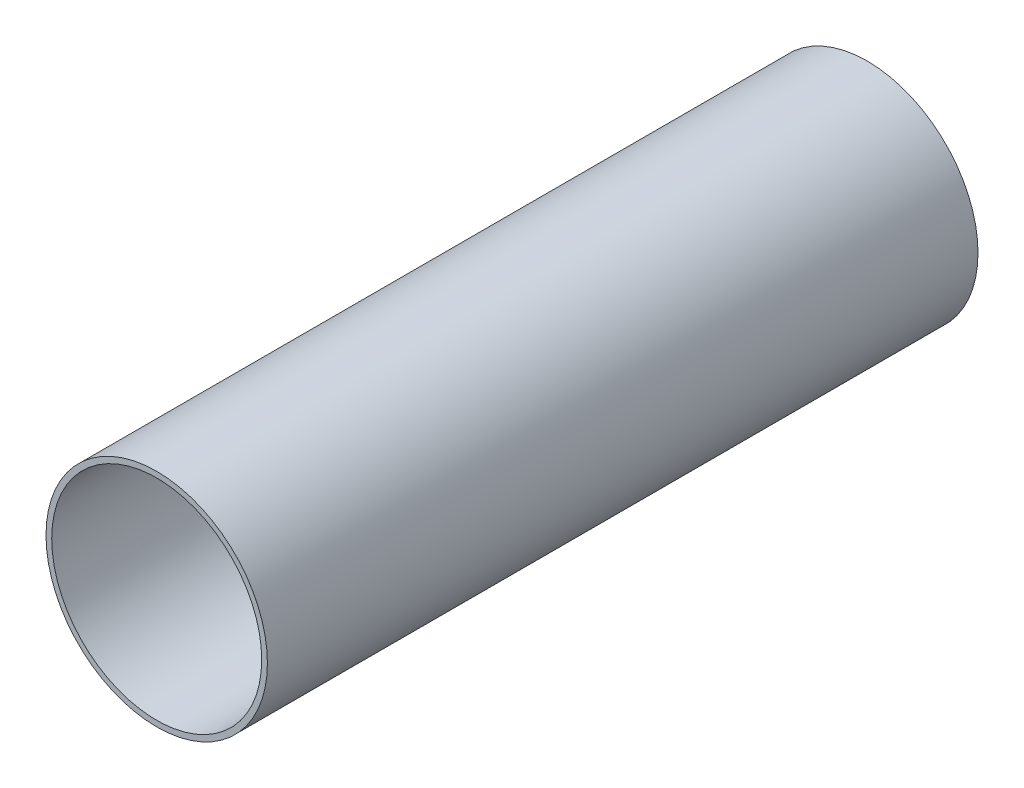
from build123d import *

# Parameters (mm, degrees)
SKETCH1_R           = 40.64
SKETCH1_R_2         = 38.5445
BOSS_EXTRUDE1_DEPTH = 257.81
BOSS_EXTRUDE2_START = 3.048
SKETCH2_R           = 40.64
SKETCH2_R_2         = 24.13
BOSS_EXTRUDE2_DEPTH = 3.048


with BuildPart() as part:
    # Sketch1 → Boss-Extrude1 (new body)
    with BuildSketch(Plane.XY):
        Circle(SKETCH1_R)
        Circle(SKETCH1_R_2, mode=Mode.SUBTRACT)
    extrude(amount=BOSS_EXTRUDE1_DEPTH)

    # Sketch2 → Boss-Extrude2 (add)
    with BuildSketch(Plane(origin=(0, 0, 0), x_dir=(-1, 0, 0), z_dir=(0, 0, -1)).offset(BOSS_EXTRUDE2_START)):
        Circle(SKETCH2_R)
        with Locations(Location((0, 0, 0), (0, 0, 180))):
            Circle(SKETCH2_R_2, mode=Mode.SUBTRACT)
    extrude(amount=-BOSS_EXTRUDE2_DEPTH)


solid = part.part
